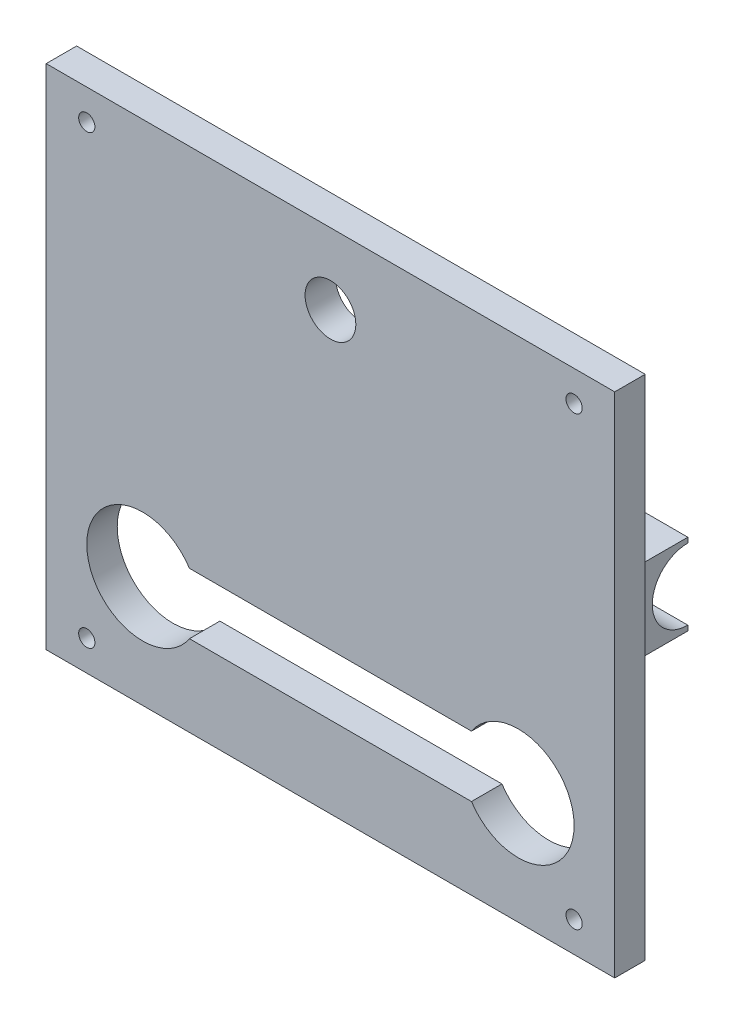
ISO-10303-21;
HEADER;
FILE_DESCRIPTION(('STEP AP214'),'2;1');
FILE_NAME('part.step','',(''),(''),'','','');
FILE_SCHEMA(('AUTOMOTIVE_DESIGN { 1 0 10303 214 1 1 1 1 }'));
ENDSEC;
DATA;
#1=APPLICATION_CONTEXT('core data for automotive mechanical design processes');
#2=APPLICATION_PROTOCOL_DEFINITION('international standard','automotive_design',2000,#1);
#3=PRODUCT_CONTEXT('',#1,'mechanical');
#4=PRODUCT('Part','Part','',(#3));
#5=PRODUCT_RELATED_PRODUCT_CATEGORY('part','',(#4));
#6=PRODUCT_DEFINITION_FORMATION('','',#4);
#7=PRODUCT_DEFINITION_CONTEXT('part definition',#1,'design');
#8=PRODUCT_DEFINITION('design','',#6,#7);
#9=PRODUCT_DEFINITION_SHAPE('','',#8);
#10=(LENGTH_UNIT() NAMED_UNIT(*) SI_UNIT(.MILLI.,.METRE.));
#11=(NAMED_UNIT(*) PLANE_ANGLE_UNIT() SI_UNIT($,.RADIAN.));
#12=(NAMED_UNIT(*) SI_UNIT($,.STERADIAN.) SOLID_ANGLE_UNIT());
#13=UNCERTAINTY_MEASURE_WITH_UNIT(LENGTH_MEASURE(1.E-05),#10,'distance_accuracy_value','');
#14=(GEOMETRIC_REPRESENTATION_CONTEXT(3) GLOBAL_UNCERTAINTY_ASSIGNED_CONTEXT((#13)) GLOBAL_UNIT_ASSIGNED_CONTEXT((#10,
#11,#12)) REPRESENTATION_CONTEXT('',''));
#15=CARTESIAN_POINT('',(0.,0.,0.));
#16=DIRECTION('',(0.,0.,1.));
#17=DIRECTION('',(1.,0.,0.));
#18=AXIS2_PLACEMENT_3D('',#15,#16,#17);
#19=CARTESIAN_POINT('',(0.,0.,-46.));
#20=DIRECTION('',(0.,0.,1.));
#21=DIRECTION('',(1.,0.,0.));
#22=AXIS2_PLACEMENT_3D('',#19,#20,#21);
#23=PLANE('',#22);
#24=DIRECTION('',(0.,1.,0.));
#25=VECTOR('',#24,1.);
#26=CARTESIAN_POINT('',(25.,-145.,-46.));
#27=LINE('',#26,#25);
#28=CARTESIAN_POINT('',(25.,-145.,-46.));
#29=VERTEX_POINT('',#28);
#30=CARTESIAN_POINT('',(25.,-142.5,-46.));
#31=VERTEX_POINT('',#30);
#32=EDGE_CURVE('E145',#29,#31,#27,.T.);
#33=ORIENTED_EDGE('',*,*,#32,.T.);
#34=DIRECTION('',(1.,0.,0.));
#35=VECTOR('',#34,1.);
#36=CARTESIAN_POINT('',(0.,-142.5,-46.));
#37=LINE('',#36,#35);
#38=CARTESIAN_POINT('',(255.,-142.5,-46.));
#39=VERTEX_POINT('',#38);
#40=EDGE_CURVE('E11',#31,#39,#37,.T.);
#41=ORIENTED_EDGE('',*,*,#40,.T.);
#42=DIRECTION('',(0.,-1.,0.));
#43=VECTOR('',#42,1.);
#44=CARTESIAN_POINT('',(255.,-145.,-46.));
#45=LINE('',#44,#43);
#46=CARTESIAN_POINT('',(255.,-145.,-46.));
#47=VERTEX_POINT('',#46);
#48=EDGE_CURVE('E142',#39,#47,#45,.T.);
#49=ORIENTED_EDGE('',*,*,#48,.T.);
#50=DIRECTION('',(-1.,0.,0.));
#51=VECTOR('',#50,1.);
#52=CARTESIAN_POINT('',(255.,-145.,-46.));
#53=LINE('',#52,#51);
#54=EDGE_CURVE('E153',#47,#29,#53,.T.);
#55=ORIENTED_EDGE('',*,*,#54,.T.);
#56=EDGE_LOOP('',(#33,#41,#49,#55));
#57=FACE_BOUND('',#56,.T.);
#58=ADVANCED_FACE('F34',(#57),#23,.F.);
#59=CARTESIAN_POINT('',(0.,0.,0.));
#60=DIRECTION('',(0.,0.,1.));
#61=DIRECTION('',(1.,0.,0.));
#62=AXIS2_PLACEMENT_3D('',#59,#60,#61);
#63=PLANE('',#62);
#64=CARTESIAN_POINT('',(260.,-235.,0.));
#65=DIRECTION('',(0.,0.,1.));
#66=DIRECTION('',(1.,0.,0.));
#67=AXIS2_PLACEMENT_3D('',#64,#65,#66);
#68=CIRCLE('',#67,3.99999999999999);
#69=CARTESIAN_POINT('',(264.,-235.,0.));
#70=VERTEX_POINT('',#69);
#71=EDGE_CURVE('E492',#70,#70,#68,.T.);
#72=ORIENTED_EDGE('',*,*,#71,.T.);
#73=EDGE_LOOP('',(#72));
#74=FACE_BOUND('',#73,.T.);
#75=CARTESIAN_POINT('',(20.,-15.,0.));
#76=DIRECTION('',(0.,0.,1.));
#77=DIRECTION('',(1.,0.,0.));
#78=AXIS2_PLACEMENT_3D('',#75,#76,#77);
#79=CIRCLE('',#78,4.);
#80=CARTESIAN_POINT('',(24.,-15.,0.));
#81=VERTEX_POINT('',#80);
#82=EDGE_CURVE('E496',#81,#81,#79,.T.);
#83=ORIENTED_EDGE('',*,*,#82,.T.);
#84=EDGE_LOOP('',(#83));
#85=FACE_BOUND('',#84,.T.);
#86=CARTESIAN_POINT('',(260.,-15.,0.));
#87=DIRECTION('',(0.,0.,1.));
#88=DIRECTION('',(1.,0.,0.));
#89=AXIS2_PLACEMENT_3D('',#86,#87,#88);
#90=CIRCLE('',#89,3.99999999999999);
#91=CARTESIAN_POINT('',(264.,-15.,0.));
#92=VERTEX_POINT('',#91);
#93=EDGE_CURVE('E497',#92,#92,#90,.T.);
#94=ORIENTED_EDGE('',*,*,#93,.T.);
#95=EDGE_LOOP('',(#94));
#96=FACE_BOUND('',#95,.T.);
#97=CARTESIAN_POINT('',(20.,-235.,0.));
#98=DIRECTION('',(0.,0.,1.));
#99=DIRECTION('',(1.,0.,0.));
#100=AXIS2_PLACEMENT_3D('',#97,#98,#99);
#101=CIRCLE('',#100,4.);
#102=CARTESIAN_POINT('',(24.,-235.,0.));
#103=VERTEX_POINT('',#102);
#104=EDGE_CURVE('E486',#103,#103,#101,.T.);
#105=ORIENTED_EDGE('',*,*,#104,.T.);
#106=EDGE_LOOP('',(#105));
#107=FACE_BOUND('',#106,.T.);
#108=CARTESIAN_POINT('',(140.,-35.,0.));
#109=DIRECTION('',(0.,0.,1.));
#110=DIRECTION('',(1.,0.,0.));
#111=AXIS2_PLACEMENT_3D('',#108,#109,#110);
#112=CIRCLE('',#111,12.5);
#113=CARTESIAN_POINT('',(152.5,-35.,0.));
#114=VERTEX_POINT('',#113);
#115=EDGE_CURVE('E169',#114,#114,#112,.T.);
#116=ORIENTED_EDGE('',*,*,#115,.T.);
#117=EDGE_LOOP('',(#116));
#118=FACE_BOUND('',#117,.T.);
#119=DIRECTION('',(0.,-1.,0.));
#120=VECTOR('',#119,1.);
#121=CARTESIAN_POINT('',(0.,0.,0.));
#122=LINE('',#121,#120);
#123=CARTESIAN_POINT('',(0.,0.,0.));
#124=VERTEX_POINT('',#123);
#125=CARTESIAN_POINT('',(0.,-250.,0.));
#126=VERTEX_POINT('',#125);
#127=EDGE_CURVE('E208',#124,#126,#122,.T.);
#128=ORIENTED_EDGE('',*,*,#127,.F.);
#129=DIRECTION('',(-1.,0.,0.));
#130=VECTOR('',#129,1.);
#131=CARTESIAN_POINT('',(0.,0.,0.));
#132=LINE('',#131,#130);
#133=CARTESIAN_POINT('',(280.,0.,0.));
#134=VERTEX_POINT('',#133);
#135=EDGE_CURVE('E219',#134,#124,#132,.T.);
#136=ORIENTED_EDGE('',*,*,#135,.F.);
#137=DIRECTION('',(0.,1.,0.));
#138=VECTOR('',#137,1.);
#139=CARTESIAN_POINT('',(280.,0.,0.));
#140=LINE('',#139,#138);
#141=CARTESIAN_POINT('',(280.,-250.,0.));
#142=VERTEX_POINT('',#141);
#143=EDGE_CURVE('E230',#142,#134,#140,.T.);
#144=ORIENTED_EDGE('',*,*,#143,.F.);
#145=DIRECTION('',(1.,0.,0.));
#146=VECTOR('',#145,1.);
#147=CARTESIAN_POINT('',(0.,-250.,0.));
#148=LINE('',#147,#146);
#149=EDGE_CURVE('E228',#126,#142,#148,.T.);
#150=ORIENTED_EDGE('',*,*,#149,.F.);
#151=EDGE_LOOP('',(#128,#136,#144,#150));
#152=FACE_BOUND('',#151,.T.);
#153=DIRECTION('',(1.,0.,0.));
#154=VECTOR('',#153,1.);
#155=CARTESIAN_POINT('',(70.5488611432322,-210.,0.));
#156=LINE('',#155,#154);
#157=CARTESIAN_POINT('',(70.5488611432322,-210.,0.));
#158=VERTEX_POINT('',#157);
#159=CARTESIAN_POINT('',(209.451138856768,-210.,0.));
#160=VERTEX_POINT('',#159);
#161=EDGE_CURVE('E193',#158,#160,#156,.T.);
#162=ORIENTED_EDGE('',*,*,#161,.T.);
#163=CARTESIAN_POINT('',(232.5,-195.,0.));
#164=DIRECTION('',(0.,0.,1.));
#165=DIRECTION('',(1.,0.,0.));
#166=AXIS2_PLACEMENT_3D('',#163,#164,#165);
#167=CIRCLE('',#166,27.5);
#168=CARTESIAN_POINT('',(209.451138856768,-180.,0.));
#169=VERTEX_POINT('',#168);
#170=EDGE_CURVE('E183',#160,#169,#167,.T.);
#171=ORIENTED_EDGE('',*,*,#170,.T.);
#172=DIRECTION('',(-1.,0.,0.));
#173=VECTOR('',#172,1.);
#174=CARTESIAN_POINT('',(70.5488611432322,-180.,0.));
#175=LINE('',#174,#173);
#176=CARTESIAN_POINT('',(70.5488611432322,-180.,0.));
#177=VERTEX_POINT('',#176);
#178=EDGE_CURVE('E186',#169,#177,#175,.T.);
#179=ORIENTED_EDGE('',*,*,#178,.T.);
#180=CARTESIAN_POINT('',(47.5,-195.,0.));
#181=DIRECTION('',(0.,0.,1.));
#182=DIRECTION('',(1.,0.,0.));
#183=AXIS2_PLACEMENT_3D('',#180,#181,#182);
#184=CIRCLE('',#183,27.5);
#185=EDGE_CURVE('E190',#177,#158,#184,.T.);
#186=ORIENTED_EDGE('',*,*,#185,.T.);
#187=EDGE_LOOP('',(#162,#171,#179,#186));
#188=FACE_BOUND('',#187,.T.);
#189=DIRECTION('',(0.,-1.,0.));
#190=VECTOR('',#189,1.);
#191=CARTESIAN_POINT('',(255.,-145.,0.));
#192=LINE('',#191,#190);
#193=CARTESIAN_POINT('',(255.,-105.,0.));
#194=VERTEX_POINT('',#193);
#195=CARTESIAN_POINT('',(255.,-145.,0.));
#196=VERTEX_POINT('',#195);
#197=EDGE_CURVE('E167',#194,#196,#192,.T.);
#198=ORIENTED_EDGE('',*,*,#197,.F.);
#199=DIRECTION('',(1.,0.,0.));
#200=VECTOR('',#199,1.);
#201=CARTESIAN_POINT('',(255.,-105.,0.));
#202=LINE('',#201,#200);
#203=CARTESIAN_POINT('',(25.,-105.,0.));
#204=VERTEX_POINT('',#203);
#205=EDGE_CURVE('E151',#204,#194,#202,.T.);
#206=ORIENTED_EDGE('',*,*,#205,.F.);
#207=DIRECTION('',(0.,1.,0.));
#208=VECTOR('',#207,1.);
#209=CARTESIAN_POINT('',(25.,-145.,0.));
#210=LINE('',#209,#208);
#211=CARTESIAN_POINT('',(25.,-145.,0.));
#212=VERTEX_POINT('',#211);
#213=EDGE_CURVE('E155',#212,#204,#210,.T.);
#214=ORIENTED_EDGE('',*,*,#213,.F.);
#215=DIRECTION('',(-1.,0.,0.));
#216=VECTOR('',#215,1.);
#217=CARTESIAN_POINT('',(255.,-145.,0.));
#218=LINE('',#217,#216);
#219=EDGE_CURVE('E57',#196,#212,#218,.T.);
#220=ORIENTED_EDGE('',*,*,#219,.F.);
#221=EDGE_LOOP('',(#198,#206,#214,#220));
#222=FACE_BOUND('',#221,.T.);
#223=ADVANCED_FACE('F253',(#74,#85,#96,#107,#118,#152,#188,#222),#63,.F.);
#224=CARTESIAN_POINT('',(0.,0.,15.));
#225=DIRECTION('',(1.,0.,0.));
#226=DIRECTION('',(0.,1.,0.));
#227=AXIS2_PLACEMENT_3D('',#224,#225,#226);
#228=PLANE('',#227);
#229=ORIENTED_EDGE('',*,*,#127,.T.);
#230=DIRECTION('',(0.,0.,-1.));
#231=VECTOR('',#230,1.);
#232=CARTESIAN_POINT('',(0.,-250.,15.));
#233=LINE('',#232,#231);
#234=CARTESIAN_POINT('',(0.,-250.,15.));
#235=VERTEX_POINT('',#234);
#236=EDGE_CURVE('E241',#235,#126,#233,.T.);
#237=ORIENTED_EDGE('',*,*,#236,.F.);
#238=DIRECTION('',(0.,-1.,0.));
#239=VECTOR('',#238,1.);
#240=CARTESIAN_POINT('',(0.,0.,15.));
#241=LINE('',#240,#239);
#242=CARTESIAN_POINT('',(0.,0.,15.));
#243=VERTEX_POINT('',#242);
#244=EDGE_CURVE('E215',#243,#235,#241,.T.);
#245=ORIENTED_EDGE('',*,*,#244,.F.);
#246=DIRECTION('',(0.,0.,-1.));
#247=VECTOR('',#246,1.);
#248=CARTESIAN_POINT('',(0.,0.,15.));
#249=LINE('',#248,#247);
#250=EDGE_CURVE('E225',#243,#124,#249,.T.);
#251=ORIENTED_EDGE('',*,*,#250,.T.);
#252=EDGE_LOOP('',(#229,#237,#245,#251));
#253=FACE_BOUND('',#252,.T.);
#254=ADVANCED_FACE('F36',(#253),#228,.F.);
#255=CARTESIAN_POINT('',(0.,-250.,15.));
#256=DIRECTION('',(0.,1.,0.));
#257=DIRECTION('',(0.,0.,1.));
#258=AXIS2_PLACEMENT_3D('',#255,#256,#257);
#259=PLANE('',#258);
#260=ORIENTED_EDGE('',*,*,#149,.T.);
#261=DIRECTION('',(0.,0.,-1.));
#262=VECTOR('',#261,1.);
#263=CARTESIAN_POINT('',(280.,-250.,15.));
#264=LINE('',#263,#262);
#265=CARTESIAN_POINT('',(280.,-250.,15.));
#266=VERTEX_POINT('',#265);
#267=EDGE_CURVE('E238',#266,#142,#264,.T.);
#268=ORIENTED_EDGE('',*,*,#267,.F.);
#269=DIRECTION('',(1.,0.,0.));
#270=VECTOR('',#269,1.);
#271=CARTESIAN_POINT('',(0.,-250.,15.));
#272=LINE('',#271,#270);
#273=EDGE_CURVE('E218',#235,#266,#272,.T.);
#274=ORIENTED_EDGE('',*,*,#273,.F.);
#275=ORIENTED_EDGE('',*,*,#236,.T.);
#276=EDGE_LOOP('',(#260,#268,#274,#275));
#277=FACE_BOUND('',#276,.T.);
#278=ADVANCED_FACE('F419',(#277),#259,.F.);
#279=CARTESIAN_POINT('',(280.,0.,15.));
#280=DIRECTION('',(-1.,0.,0.));
#281=DIRECTION('',(0.,-1.,0.));
#282=AXIS2_PLACEMENT_3D('',#279,#280,#281);
#283=PLANE('',#282);
#284=ORIENTED_EDGE('',*,*,#143,.T.);
#285=DIRECTION('',(0.,0.,-1.));
#286=VECTOR('',#285,1.);
#287=CARTESIAN_POINT('',(280.,0.,15.));
#288=LINE('',#287,#286);
#289=CARTESIAN_POINT('',(280.,0.,15.));
#290=VERTEX_POINT('',#289);
#291=EDGE_CURVE('E235',#290,#134,#288,.T.);
#292=ORIENTED_EDGE('',*,*,#291,.F.);
#293=DIRECTION('',(0.,1.,0.));
#294=VECTOR('',#293,1.);
#295=CARTESIAN_POINT('',(280.,0.,15.));
#296=LINE('',#295,#294);
#297=EDGE_CURVE('E221',#266,#290,#296,.T.);
#298=ORIENTED_EDGE('',*,*,#297,.F.);
#299=ORIENTED_EDGE('',*,*,#267,.T.);
#300=EDGE_LOOP('',(#284,#292,#298,#299));
#301=FACE_BOUND('',#300,.T.);
#302=ADVANCED_FACE('F417',(#301),#283,.F.);
#303=CARTESIAN_POINT('',(0.,0.,15.));
#304=DIRECTION('',(0.,-1.,0.));
#305=DIRECTION('',(0.,0.,-1.));
#306=AXIS2_PLACEMENT_3D('',#303,#304,#305);
#307=PLANE('',#306);
#308=ORIENTED_EDGE('',*,*,#135,.T.);
#309=ORIENTED_EDGE('',*,*,#250,.F.);
#310=DIRECTION('',(-1.,0.,0.));
#311=VECTOR('',#310,1.);
#312=CARTESIAN_POINT('',(0.,0.,15.));
#313=LINE('',#312,#311);
#314=EDGE_CURVE('E223',#290,#243,#313,.T.);
#315=ORIENTED_EDGE('',*,*,#314,.F.);
#316=ORIENTED_EDGE('',*,*,#291,.T.);
#317=EDGE_LOOP('',(#308,#309,#315,#316));
#318=FACE_BOUND('',#317,.T.);
#319=ADVANCED_FACE('F361',(#318),#307,.F.);
#320=CARTESIAN_POINT('',(0.,0.,15.));
#321=DIRECTION('',(0.,0.,1.));
#322=DIRECTION('',(1.,0.,0.));
#323=AXIS2_PLACEMENT_3D('',#320,#321,#322);
#324=PLANE('',#323);
#325=CARTESIAN_POINT('',(260.,-235.,15.));
#326=DIRECTION('',(0.,0.,1.));
#327=DIRECTION('',(1.,0.,0.));
#328=AXIS2_PLACEMENT_3D('',#325,#326,#327);
#329=CIRCLE('',#328,3.99999999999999);
#330=CARTESIAN_POINT('',(264.,-235.,15.));
#331=VERTEX_POINT('',#330);
#332=EDGE_CURVE('E470',#331,#331,#329,.T.);
#333=ORIENTED_EDGE('',*,*,#332,.F.);
#334=EDGE_LOOP('',(#333));
#335=FACE_BOUND('',#334,.T.);
#336=CARTESIAN_POINT('',(20.,-15.,15.));
#337=DIRECTION('',(0.,0.,1.));
#338=DIRECTION('',(1.,0.,0.));
#339=AXIS2_PLACEMENT_3D('',#336,#337,#338);
#340=CIRCLE('',#339,4.);
#341=CARTESIAN_POINT('',(24.,-15.,15.));
#342=VERTEX_POINT('',#341);
#343=EDGE_CURVE('E474',#342,#342,#340,.T.);
#344=ORIENTED_EDGE('',*,*,#343,.F.);
#345=EDGE_LOOP('',(#344));
#346=FACE_BOUND('',#345,.T.);
#347=CARTESIAN_POINT('',(260.,-15.,15.));
#348=DIRECTION('',(0.,0.,1.));
#349=DIRECTION('',(1.,0.,0.));
#350=AXIS2_PLACEMENT_3D('',#347,#348,#349);
#351=CIRCLE('',#350,3.99999999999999);
#352=CARTESIAN_POINT('',(264.,-15.,15.));
#353=VERTEX_POINT('',#352);
#354=EDGE_CURVE('E478',#353,#353,#351,.T.);
#355=ORIENTED_EDGE('',*,*,#354,.F.);
#356=EDGE_LOOP('',(#355));
#357=FACE_BOUND('',#356,.T.);
#358=CARTESIAN_POINT('',(20.,-235.,15.));
#359=DIRECTION('',(0.,0.,1.));
#360=DIRECTION('',(1.,0.,0.));
#361=AXIS2_PLACEMENT_3D('',#358,#359,#360);
#362=CIRCLE('',#361,4.);
#363=CARTESIAN_POINT('',(24.,-235.,15.));
#364=VERTEX_POINT('',#363);
#365=EDGE_CURVE('E482',#364,#364,#362,.T.);
#366=ORIENTED_EDGE('',*,*,#365,.F.);
#367=EDGE_LOOP('',(#366));
#368=FACE_BOUND('',#367,.T.);
#369=CARTESIAN_POINT('',(140.,-35.,15.));
#370=DIRECTION('',(0.,0.,1.));
#371=DIRECTION('',(1.,0.,0.));
#372=AXIS2_PLACEMENT_3D('',#369,#370,#371);
#373=CIRCLE('',#372,12.5);
#374=CARTESIAN_POINT('',(152.5,-35.,15.));
#375=VERTEX_POINT('',#374);
#376=EDGE_CURVE('E159',#375,#375,#373,.T.);
#377=ORIENTED_EDGE('',*,*,#376,.F.);
#378=EDGE_LOOP('',(#377));
#379=FACE_BOUND('',#378,.T.);
#380=CARTESIAN_POINT('',(232.5,-195.,15.));
#381=DIRECTION('',(0.,0.,1.));
#382=DIRECTION('',(1.,0.,0.));
#383=AXIS2_PLACEMENT_3D('',#380,#381,#382);
#384=CIRCLE('',#383,27.5);
#385=CARTESIAN_POINT('',(209.451138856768,-210.,15.));
#386=VERTEX_POINT('',#385);
#387=CARTESIAN_POINT('',(209.451138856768,-180.,15.));
#388=VERTEX_POINT('',#387);
#389=EDGE_CURVE('E182',#386,#388,#384,.T.);
#390=ORIENTED_EDGE('',*,*,#389,.F.);
#391=DIRECTION('',(1.,0.,0.));
#392=VECTOR('',#391,1.);
#393=CARTESIAN_POINT('',(70.5488611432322,-210.,15.));
#394=LINE('',#393,#392);
#395=CARTESIAN_POINT('',(70.5488611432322,-210.,15.));
#396=VERTEX_POINT('',#395);
#397=EDGE_CURVE('E187',#396,#386,#394,.T.);
#398=ORIENTED_EDGE('',*,*,#397,.F.);
#399=CARTESIAN_POINT('',(47.5,-195.,15.));
#400=DIRECTION('',(0.,0.,1.));
#401=DIRECTION('',(1.,0.,0.));
#402=AXIS2_PLACEMENT_3D('',#399,#400,#401);
#403=CIRCLE('',#402,27.5);
#404=CARTESIAN_POINT('',(70.5488611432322,-180.,15.));
#405=VERTEX_POINT('',#404);
#406=EDGE_CURVE('E201',#405,#396,#403,.T.);
#407=ORIENTED_EDGE('',*,*,#406,.F.);
#408=DIRECTION('',(-1.,0.,0.));
#409=VECTOR('',#408,1.);
#410=CARTESIAN_POINT('',(70.5488611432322,-180.,15.));
#411=LINE('',#410,#409);
#412=EDGE_CURVE('E198',#388,#405,#411,.T.);
#413=ORIENTED_EDGE('',*,*,#412,.F.);
#414=EDGE_LOOP('',(#390,#398,#407,#413));
#415=FACE_BOUND('',#414,.T.);
#416=ORIENTED_EDGE('',*,*,#244,.T.);
#417=ORIENTED_EDGE('',*,*,#273,.T.);
#418=ORIENTED_EDGE('',*,*,#297,.T.);
#419=ORIENTED_EDGE('',*,*,#314,.T.);
#420=EDGE_LOOP('',(#416,#417,#418,#419));
#421=FACE_BOUND('',#420,.T.);
#422=ADVANCED_FACE('F356',(#335,#346,#357,#368,#379,#415,#421),#324,.T.);
#423=CARTESIAN_POINT('',(232.5,-195.,0.));
#424=DIRECTION('',(0.,0.,1.));
#425=DIRECTION('',(1.,0.,0.));
#426=AXIS2_PLACEMENT_3D('',#423,#424,#425);
#427=CYLINDRICAL_SURFACE('',#426,27.5);
#428=ORIENTED_EDGE('',*,*,#389,.T.);
#429=DIRECTION('',(0.,0.,1.));
#430=VECTOR('',#429,1.);
#431=CARTESIAN_POINT('',(209.451138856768,-180.,0.));
#432=LINE('',#431,#430);
#433=EDGE_CURVE('E196',#169,#388,#432,.T.);
#434=ORIENTED_EDGE('',*,*,#433,.F.);
#435=ORIENTED_EDGE('',*,*,#170,.F.);
#436=DIRECTION('',(0.,0.,1.));
#437=VECTOR('',#436,1.);
#438=CARTESIAN_POINT('',(209.451138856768,-210.,0.));
#439=LINE('',#438,#437);
#440=EDGE_CURVE('E206',#160,#386,#439,.T.);
#441=ORIENTED_EDGE('',*,*,#440,.T.);
#442=EDGE_LOOP('',(#428,#434,#435,#441));
#443=FACE_BOUND('',#442,.T.);
#444=ADVANCED_FACE('F360',(#443),#427,.F.);
#445=CARTESIAN_POINT('',(70.5488611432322,-210.,0.));
#446=DIRECTION('',(0.,-1.,0.));
#447=DIRECTION('',(1.,0.,0.));
#448=AXIS2_PLACEMENT_3D('',#445,#446,#447);
#449=PLANE('',#448);
#450=ORIENTED_EDGE('',*,*,#397,.T.);
#451=ORIENTED_EDGE('',*,*,#440,.F.);
#452=ORIENTED_EDGE('',*,*,#161,.F.);
#453=DIRECTION('',(0.,0.,1.));
#454=VECTOR('',#453,1.);
#455=CARTESIAN_POINT('',(70.5488611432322,-210.,0.));
#456=LINE('',#455,#454);
#457=EDGE_CURVE('E209',#158,#396,#456,.T.);
#458=ORIENTED_EDGE('',*,*,#457,.T.);
#459=EDGE_LOOP('',(#450,#451,#452,#458));
#460=FACE_BOUND('',#459,.T.);
#461=ADVANCED_FACE('F377',(#460),#449,.F.);
#462=CARTESIAN_POINT('',(47.5,-195.,0.));
#463=DIRECTION('',(0.,0.,1.));
#464=DIRECTION('',(1.,0.,0.));
#465=AXIS2_PLACEMENT_3D('',#462,#463,#464);
#466=CYLINDRICAL_SURFACE('',#465,27.5);
#467=ORIENTED_EDGE('',*,*,#406,.T.);
#468=ORIENTED_EDGE('',*,*,#457,.F.);
#469=ORIENTED_EDGE('',*,*,#185,.F.);
#470=DIRECTION('',(0.,0.,1.));
#471=VECTOR('',#470,1.);
#472=CARTESIAN_POINT('',(70.5488611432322,-180.,0.));
#473=LINE('',#472,#471);
#474=EDGE_CURVE('E211',#177,#405,#473,.T.);
#475=ORIENTED_EDGE('',*,*,#474,.T.);
#476=EDGE_LOOP('',(#467,#468,#469,#475));
#477=FACE_BOUND('',#476,.T.);
#478=ADVANCED_FACE('F384',(#477),#466,.F.);
#479=CARTESIAN_POINT('',(70.5488611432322,-180.,0.));
#480=DIRECTION('',(0.,1.,0.));
#481=DIRECTION('',(-1.,0.,0.));
#482=AXIS2_PLACEMENT_3D('',#479,#480,#481);
#483=PLANE('',#482);
#484=ORIENTED_EDGE('',*,*,#412,.T.);
#485=ORIENTED_EDGE('',*,*,#474,.F.);
#486=ORIENTED_EDGE('',*,*,#178,.F.);
#487=ORIENTED_EDGE('',*,*,#433,.T.);
#488=EDGE_LOOP('',(#484,#485,#486,#487));
#489=FACE_BOUND('',#488,.T.);
#490=ADVANCED_FACE('F264',(#489),#483,.F.);
#491=CARTESIAN_POINT('',(255.,-145.,-46.));
#492=DIRECTION('',(-1.,0.,0.));
#493=DIRECTION('',(0.,0.,1.));
#494=AXIS2_PLACEMENT_3D('',#491,#492,#493);
#495=PLANE('',#494);
#496=ORIENTED_EDGE('',*,*,#48,.F.);
#497=CARTESIAN_POINT('',(255.,-125.,-46.));
#498=DIRECTION('',(1.,0.,0.));
#499=DIRECTION('',(0.,0.,1.));
#500=AXIS2_PLACEMENT_3D('',#497,#498,#499);
#501=CIRCLE('',#500,17.5);
#502=CARTESIAN_POINT('',(255.,-107.5,-46.));
#503=VERTEX_POINT('',#502);
#504=EDGE_CURVE('E133',#503,#39,#501,.T.);
#505=ORIENTED_EDGE('',*,*,#504,.F.);
#506=CARTESIAN_POINT('',(255.,-105.,-46.));
#507=VERTEX_POINT('',#506);
#508=EDGE_CURVE('E150',#507,#503,#45,.T.);
#509=ORIENTED_EDGE('',*,*,#508,.F.);
#510=DIRECTION('',(0.,0.,1.));
#511=VECTOR('',#510,1.);
#512=CARTESIAN_POINT('',(255.,-105.,-46.));
#513=LINE('',#512,#511);
#514=EDGE_CURVE('E166',#507,#194,#513,.T.);
#515=ORIENTED_EDGE('',*,*,#514,.T.);
#516=ORIENTED_EDGE('',*,*,#197,.T.);
#517=DIRECTION('',(0.,0.,1.));
#518=VECTOR('',#517,1.);
#519=CARTESIAN_POINT('',(255.,-145.,-46.));
#520=LINE('',#519,#518);
#521=EDGE_CURVE('E149',#47,#196,#520,.T.);
#522=ORIENTED_EDGE('',*,*,#521,.F.);
#523=EDGE_LOOP('',(#496,#505,#509,#515,#516,#522));
#524=FACE_BOUND('',#523,.T.);
#525=ADVANCED_FACE('F147',(#524),#495,.F.);
#526=CARTESIAN_POINT('',(255.,-145.,-46.));
#527=DIRECTION('',(0.,1.,0.));
#528=DIRECTION('',(0.,0.,1.));
#529=AXIS2_PLACEMENT_3D('',#526,#527,#528);
#530=PLANE('',#529);
#531=ORIENTED_EDGE('',*,*,#219,.T.);
#532=DIRECTION('',(0.,0.,1.));
#533=VECTOR('',#532,1.);
#534=CARTESIAN_POINT('',(25.,-145.,-46.));
#535=LINE('',#534,#533);
#536=EDGE_CURVE('E178',#29,#212,#535,.T.);
#537=ORIENTED_EDGE('',*,*,#536,.F.);
#538=ORIENTED_EDGE('',*,*,#54,.F.);
#539=ORIENTED_EDGE('',*,*,#521,.T.);
#540=EDGE_LOOP('',(#531,#537,#538,#539));
#541=FACE_BOUND('',#540,.T.);
#542=ADVANCED_FACE('F256',(#541),#530,.F.);
#543=CARTESIAN_POINT('',(25.,-145.,-46.));
#544=DIRECTION('',(1.,0.,0.));
#545=DIRECTION('',(0.,1.,0.));
#546=AXIS2_PLACEMENT_3D('',#543,#544,#545);
#547=PLANE('',#546);
#548=CARTESIAN_POINT('',(25.,-107.5,-46.));
#549=VERTEX_POINT('',#548);
#550=CARTESIAN_POINT('',(25.,-105.,-46.));
#551=VERTEX_POINT('',#550);
#552=EDGE_CURVE('E162',#549,#551,#27,.T.);
#553=ORIENTED_EDGE('',*,*,#552,.F.);
#554=CARTESIAN_POINT('',(25.,-125.,-46.));
#555=DIRECTION('',(1.,0.,0.));
#556=DIRECTION('',(0.,1.,0.));
#557=AXIS2_PLACEMENT_3D('',#554,#555,#556);
#558=CIRCLE('',#557,17.5);
#559=EDGE_CURVE('E49',#549,#31,#558,.T.);
#560=ORIENTED_EDGE('',*,*,#559,.T.);
#561=ORIENTED_EDGE('',*,*,#32,.F.);
#562=ORIENTED_EDGE('',*,*,#536,.T.);
#563=ORIENTED_EDGE('',*,*,#213,.T.);
#564=DIRECTION('',(0.,0.,1.));
#565=VECTOR('',#564,1.);
#566=CARTESIAN_POINT('',(25.,-105.,-46.));
#567=LINE('',#566,#565);
#568=EDGE_CURVE('E175',#551,#204,#567,.T.);
#569=ORIENTED_EDGE('',*,*,#568,.F.);
#570=EDGE_LOOP('',(#553,#560,#561,#562,#563,#569));
#571=FACE_BOUND('',#570,.T.);
#572=ADVANCED_FACE('F248',(#571),#547,.F.);
#573=CARTESIAN_POINT('',(255.,-105.,-46.));
#574=DIRECTION('',(0.,-1.,0.));
#575=DIRECTION('',(1.,0.,0.));
#576=AXIS2_PLACEMENT_3D('',#573,#574,#575);
#577=PLANE('',#576);
#578=ORIENTED_EDGE('',*,*,#205,.T.);
#579=ORIENTED_EDGE('',*,*,#514,.F.);
#580=DIRECTION('',(1.,0.,0.));
#581=VECTOR('',#580,1.);
#582=CARTESIAN_POINT('',(255.,-105.,-46.));
#583=LINE('',#582,#581);
#584=EDGE_CURVE('E164',#551,#507,#583,.T.);
#585=ORIENTED_EDGE('',*,*,#584,.F.);
#586=ORIENTED_EDGE('',*,*,#568,.T.);
#587=EDGE_LOOP('',(#578,#579,#585,#586));
#588=FACE_BOUND('',#587,.T.);
#589=ADVANCED_FACE('F252',(#588),#577,.F.);
#590=ORIENTED_EDGE('',*,*,#508,.T.);
#591=DIRECTION('',(1.,0.,0.));
#592=VECTOR('',#591,1.);
#593=CARTESIAN_POINT('',(0.,-107.5,-46.));
#594=LINE('',#593,#592);
#595=EDGE_CURVE('E42',#503,#549,#594,.F.);
#596=ORIENTED_EDGE('',*,*,#595,.T.);
#597=ORIENTED_EDGE('',*,*,#552,.T.);
#598=ORIENTED_EDGE('',*,*,#584,.T.);
#599=EDGE_LOOP('',(#590,#596,#597,#598));
#600=FACE_BOUND('',#599,.T.);
#601=ADVANCED_FACE('F245',(#600),#23,.F.);
#602=CARTESIAN_POINT('',(140.,-35.,0.));
#603=DIRECTION('',(0.,0.,1.));
#604=DIRECTION('',(1.,0.,0.));
#605=AXIS2_PLACEMENT_3D('',#602,#603,#604);
#606=CYLINDRICAL_SURFACE('',#605,12.5);
#607=ORIENTED_EDGE('',*,*,#115,.F.);
#608=EDGE_LOOP('',(#607));
#609=FACE_BOUND('',#608,.T.);
#610=ORIENTED_EDGE('',*,*,#376,.T.);
#611=EDGE_LOOP('',(#610));
#612=FACE_BOUND('',#611,.T.);
#613=ADVANCED_FACE('F276',(#609,#612),#606,.F.);
#614=CARTESIAN_POINT('',(20.,-235.,0.));
#615=DIRECTION('',(0.,0.,1.));
#616=DIRECTION('',(1.,0.,0.));
#617=AXIS2_PLACEMENT_3D('',#614,#615,#616);
#618=CYLINDRICAL_SURFACE('',#617,4.);
#619=ORIENTED_EDGE('',*,*,#104,.F.);
#620=EDGE_LOOP('',(#619));
#621=FACE_BOUND('',#620,.T.);
#622=ORIENTED_EDGE('',*,*,#365,.T.);
#623=EDGE_LOOP('',(#622));
#624=FACE_BOUND('',#623,.T.);
#625=ADVANCED_FACE('F281',(#621,#624),#618,.F.);
#626=CARTESIAN_POINT('',(260.,-15.,0.));
#627=DIRECTION('',(0.,0.,1.));
#628=DIRECTION('',(1.,0.,0.));
#629=AXIS2_PLACEMENT_3D('',#626,#627,#628);
#630=CYLINDRICAL_SURFACE('',#629,3.99999999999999);
#631=ORIENTED_EDGE('',*,*,#93,.F.);
#632=EDGE_LOOP('',(#631));
#633=FACE_BOUND('',#632,.T.);
#634=ORIENTED_EDGE('',*,*,#354,.T.);
#635=EDGE_LOOP('',(#634));
#636=FACE_BOUND('',#635,.T.);
#637=ADVANCED_FACE('F325',(#633,#636),#630,.F.);
#638=CARTESIAN_POINT('',(20.,-15.,0.));
#639=DIRECTION('',(0.,0.,1.));
#640=DIRECTION('',(1.,0.,0.));
#641=AXIS2_PLACEMENT_3D('',#638,#639,#640);
#642=CYLINDRICAL_SURFACE('',#641,4.);
#643=ORIENTED_EDGE('',*,*,#82,.F.);
#644=EDGE_LOOP('',(#643));
#645=FACE_BOUND('',#644,.T.);
#646=ORIENTED_EDGE('',*,*,#343,.T.);
#647=EDGE_LOOP('',(#646));
#648=FACE_BOUND('',#647,.T.);
#649=ADVANCED_FACE('F317',(#645,#648),#642,.F.);
#650=CARTESIAN_POINT('',(260.,-235.,0.));
#651=DIRECTION('',(0.,0.,1.));
#652=DIRECTION('',(1.,0.,0.));
#653=AXIS2_PLACEMENT_3D('',#650,#651,#652);
#654=CYLINDRICAL_SURFACE('',#653,3.99999999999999);
#655=ORIENTED_EDGE('',*,*,#71,.F.);
#656=EDGE_LOOP('',(#655));
#657=FACE_BOUND('',#656,.T.);
#658=ORIENTED_EDGE('',*,*,#332,.T.);
#659=EDGE_LOOP('',(#658));
#660=FACE_BOUND('',#659,.T.);
#661=ADVANCED_FACE('F307',(#657,#660),#654,.F.);
#662=CARTESIAN_POINT('',(0.,-125.,-46.));
#663=DIRECTION('',(1.,0.,0.));
#664=DIRECTION('',(0.,0.,-1.));
#665=AXIS2_PLACEMENT_3D('',#662,#663,#664);
#666=CYLINDRICAL_SURFACE('',#665,17.5);
#667=ORIENTED_EDGE('',*,*,#595,.F.);
#668=ORIENTED_EDGE('',*,*,#504,.T.);
#669=ORIENTED_EDGE('',*,*,#40,.F.);
#670=ORIENTED_EDGE('',*,*,#559,.F.);
#671=EDGE_LOOP('',(#667,#668,#669,#670));
#672=FACE_BOUND('',#671,.T.);
#673=ADVANCED_FACE('F134',(#672),#666,.F.);
#674=CLOSED_SHELL('',(#58,#223,#254,#278,#302,#319,#422,#444,#461,#478,#490,#525,#542,#572,#589,
#601,#613,#625,#637,#649,#661,#673));
#675=MANIFOLD_SOLID_BREP('B2',#674);
#676=ADVANCED_BREP_SHAPE_REPRESENTATION('',(#18,#675),#14);
#677=SHAPE_DEFINITION_REPRESENTATION(#9,#676);
ENDSEC;
END-ISO-10303-21;
